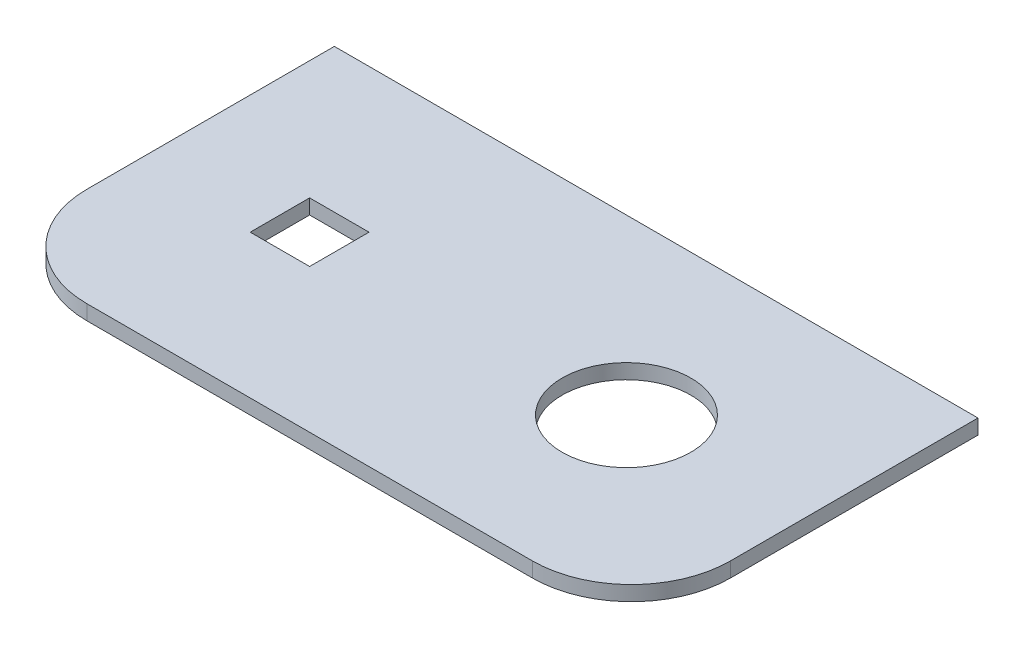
ISO-10303-21;
HEADER;
FILE_DESCRIPTION(('STEP AP214'),'2;1');
FILE_NAME('part.step','',(''),(''),'','','');
FILE_SCHEMA(('AUTOMOTIVE_DESIGN { 1 0 10303 214 1 1 1 1 }'));
ENDSEC;
DATA;
#1=APPLICATION_CONTEXT('core data for automotive mechanical design processes');
#2=APPLICATION_PROTOCOL_DEFINITION('international standard','automotive_design',2000,#1);
#3=PRODUCT_CONTEXT('',#1,'mechanical');
#4=PRODUCT('Part','Part','',(#3));
#5=PRODUCT_RELATED_PRODUCT_CATEGORY('part','',(#4));
#6=PRODUCT_DEFINITION_FORMATION('','',#4);
#7=PRODUCT_DEFINITION_CONTEXT('part definition',#1,'design');
#8=PRODUCT_DEFINITION('design','',#6,#7);
#9=PRODUCT_DEFINITION_SHAPE('','',#8);
#10=(LENGTH_UNIT() NAMED_UNIT(*) SI_UNIT(.MILLI.,.METRE.));
#11=(NAMED_UNIT(*) PLANE_ANGLE_UNIT() SI_UNIT($,.RADIAN.));
#12=(NAMED_UNIT(*) SI_UNIT($,.STERADIAN.) SOLID_ANGLE_UNIT());
#13=UNCERTAINTY_MEASURE_WITH_UNIT(LENGTH_MEASURE(1.E-05),#10,'distance_accuracy_value','');
#14=(GEOMETRIC_REPRESENTATION_CONTEXT(3) GLOBAL_UNCERTAINTY_ASSIGNED_CONTEXT((#13)) GLOBAL_UNIT_ASSIGNED_CONTEXT((#10,
#11,#12)) REPRESENTATION_CONTEXT('',''));
#15=CARTESIAN_POINT('',(0.,0.,0.));
#16=DIRECTION('',(0.,0.,1.));
#17=DIRECTION('',(1.,0.,0.));
#18=AXIS2_PLACEMENT_3D('',#15,#16,#17);
#19=CARTESIAN_POINT('',(20.,3.,-20.));
#20=DIRECTION('',(0.,-1.,0.));
#21=DIRECTION('',(0.,0.,-1.));
#22=AXIS2_PLACEMENT_3D('',#19,#20,#21);
#23=PLANE('',#22);
#24=DIRECTION('',(0.,0.,-1.));
#25=VECTOR('',#24,1.);
#26=CARTESIAN_POINT('',(130.,3.,-20.0000000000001));
#27=LINE('',#26,#25);
#28=CARTESIAN_POINT('',(130.,3.,-20.0000000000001));
#29=VERTEX_POINT('',#28);
#30=CARTESIAN_POINT('',(130.,3.,-70.));
#31=VERTEX_POINT('',#30);
#32=EDGE_CURVE('E174',#29,#31,#27,.T.);
#33=ORIENTED_EDGE('',*,*,#32,.T.);
#34=DIRECTION('',(-1.,0.,0.));
#35=VECTOR('',#34,1.);
#36=CARTESIAN_POINT('',(0.,3.,-70.));
#37=LINE('',#36,#35);
#38=CARTESIAN_POINT('',(0.,3.,-70.));
#39=VERTEX_POINT('',#38);
#40=EDGE_CURVE('E178',#31,#39,#37,.T.);
#41=ORIENTED_EDGE('',*,*,#40,.T.);
#42=DIRECTION('',(0.,0.,1.));
#43=VECTOR('',#42,1.);
#44=CARTESIAN_POINT('',(0.,3.,-20.0000000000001));
#45=LINE('',#44,#43);
#46=CARTESIAN_POINT('',(0.,3.,-20.0000000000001));
#47=VERTEX_POINT('',#46);
#48=EDGE_CURVE('E182',#39,#47,#45,.T.);
#49=ORIENTED_EDGE('',*,*,#48,.T.);
#50=CARTESIAN_POINT('',(20.,3.,-20.));
#51=DIRECTION('',(0.,1.,0.));
#52=DIRECTION('',(0.,0.,-1.));
#53=AXIS2_PLACEMENT_3D('',#50,#51,#52);
#54=CIRCLE('',#53,20.);
#55=CARTESIAN_POINT('',(20.0000000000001,3.,0.));
#56=VERTEX_POINT('',#55);
#57=EDGE_CURVE('E185',#47,#56,#54,.T.);
#58=ORIENTED_EDGE('',*,*,#57,.T.);
#59=DIRECTION('',(1.,0.,0.));
#60=VECTOR('',#59,1.);
#61=CARTESIAN_POINT('',(20.0000000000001,3.,0.));
#62=LINE('',#61,#60);
#63=CARTESIAN_POINT('',(110.,3.,0.));
#64=VERTEX_POINT('',#63);
#65=EDGE_CURVE('E188',#56,#64,#62,.T.);
#66=ORIENTED_EDGE('',*,*,#65,.T.);
#67=CARTESIAN_POINT('',(110.,3.,-20.));
#68=DIRECTION('',(0.,1.,0.));
#69=DIRECTION('',(0.,0.,1.));
#70=AXIS2_PLACEMENT_3D('',#67,#68,#69);
#71=CIRCLE('',#70,20.);
#72=EDGE_CURVE('E191',#64,#29,#71,.T.);
#73=ORIENTED_EDGE('',*,*,#72,.T.);
#74=EDGE_LOOP('',(#33,#41,#49,#58,#66,#73));
#75=FACE_BOUND('',#74,.T.);
#76=DIRECTION('',(0.,0.,-1.));
#77=VECTOR('',#76,1.);
#78=CARTESIAN_POINT('',(36.,3.,-41.));
#79=LINE('',#78,#77);
#80=CARTESIAN_POINT('',(36.,3.,-29.));
#81=VERTEX_POINT('',#80);
#82=CARTESIAN_POINT('',(36.,3.,-41.));
#83=VERTEX_POINT('',#82);
#84=EDGE_CURVE('E123',#81,#83,#79,.T.);
#85=ORIENTED_EDGE('',*,*,#84,.F.);
#86=DIRECTION('',(1.,0.,0.));
#87=VECTOR('',#86,1.);
#88=CARTESIAN_POINT('',(24.,3.,-29.));
#89=LINE('',#88,#87);
#90=CARTESIAN_POINT('',(24.,3.,-29.));
#91=VERTEX_POINT('',#90);
#92=EDGE_CURVE('E150',#91,#81,#89,.T.);
#93=ORIENTED_EDGE('',*,*,#92,.F.);
#94=DIRECTION('',(0.,0.,1.));
#95=VECTOR('',#94,1.);
#96=CARTESIAN_POINT('',(24.,3.,-41.));
#97=LINE('',#96,#95);
#98=CARTESIAN_POINT('',(24.,3.,-41.));
#99=VERTEX_POINT('',#98);
#100=EDGE_CURVE('E146',#99,#91,#97,.T.);
#101=ORIENTED_EDGE('',*,*,#100,.F.);
#102=DIRECTION('',(-1.,0.,0.));
#103=VECTOR('',#102,1.);
#104=CARTESIAN_POINT('',(24.,3.,-41.));
#105=LINE('',#104,#103);
#106=EDGE_CURVE('E132',#83,#99,#105,.T.);
#107=ORIENTED_EDGE('',*,*,#106,.F.);
#108=EDGE_LOOP('',(#85,#93,#101,#107));
#109=FACE_BOUND('',#108,.T.);
#110=CARTESIAN_POINT('',(94.,3.,-35.));
#111=DIRECTION('',(0.,1.,0.));
#112=DIRECTION('',(0.,0.,1.));
#113=AXIS2_PLACEMENT_3D('',#110,#111,#112);
#114=CIRCLE('',#113,13.);
#115=CARTESIAN_POINT('',(94.,3.,-22.));
#116=VERTEX_POINT('',#115);
#117=EDGE_CURVE('E158',#116,#116,#114,.T.);
#118=ORIENTED_EDGE('',*,*,#117,.F.);
#119=EDGE_LOOP('',(#118));
#120=FACE_BOUND('',#119,.T.);
#121=ADVANCED_FACE('F45',(#75,#109,#120),#23,.F.);
#122=CARTESIAN_POINT('',(20.,0.,-20.));
#123=DIRECTION('',(0.,-1.,0.));
#124=DIRECTION('',(0.,0.,-1.));
#125=AXIS2_PLACEMENT_3D('',#122,#123,#124);
#126=PLANE('',#125);
#127=DIRECTION('',(1.,0.,0.));
#128=VECTOR('',#127,1.);
#129=CARTESIAN_POINT('',(24.,0.,-29.));
#130=LINE('',#129,#128);
#131=CARTESIAN_POINT('',(24.,0.,-29.));
#132=VERTEX_POINT('',#131);
#133=CARTESIAN_POINT('',(36.,0.,-29.));
#134=VERTEX_POINT('',#133);
#135=EDGE_CURVE('E133',#132,#134,#130,.T.);
#136=ORIENTED_EDGE('',*,*,#135,.T.);
#137=DIRECTION('',(0.,0.,-1.));
#138=VECTOR('',#137,1.);
#139=CARTESIAN_POINT('',(36.,0.,-41.));
#140=LINE('',#139,#138);
#141=CARTESIAN_POINT('',(36.,0.,-41.));
#142=VERTEX_POINT('',#141);
#143=EDGE_CURVE('E69',#134,#142,#140,.T.);
#144=ORIENTED_EDGE('',*,*,#143,.T.);
#145=DIRECTION('',(-1.,0.,0.));
#146=VECTOR('',#145,1.);
#147=CARTESIAN_POINT('',(24.,0.,-41.));
#148=LINE('',#147,#146);
#149=CARTESIAN_POINT('',(24.,0.,-41.));
#150=VERTEX_POINT('',#149);
#151=EDGE_CURVE('E139',#142,#150,#148,.T.);
#152=ORIENTED_EDGE('',*,*,#151,.T.);
#153=DIRECTION('',(0.,0.,1.));
#154=VECTOR('',#153,1.);
#155=CARTESIAN_POINT('',(24.,0.,-41.));
#156=LINE('',#155,#154);
#157=EDGE_CURVE('E161',#150,#132,#156,.T.);
#158=ORIENTED_EDGE('',*,*,#157,.T.);
#159=EDGE_LOOP('',(#136,#144,#152,#158));
#160=FACE_BOUND('',#159,.T.);
#161=DIRECTION('',(0.,0.,-1.));
#162=VECTOR('',#161,1.);
#163=CARTESIAN_POINT('',(130.,0.,-20.0000000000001));
#164=LINE('',#163,#162);
#165=CARTESIAN_POINT('',(130.,0.,-20.0000000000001));
#166=VERTEX_POINT('',#165);
#167=CARTESIAN_POINT('',(130.,0.,-70.));
#168=VERTEX_POINT('',#167);
#169=EDGE_CURVE('E141',#166,#168,#164,.T.);
#170=ORIENTED_EDGE('',*,*,#169,.F.);
#171=CARTESIAN_POINT('',(110.,0.,-20.));
#172=DIRECTION('',(0.,1.,0.));
#173=DIRECTION('',(0.,0.,1.));
#174=AXIS2_PLACEMENT_3D('',#171,#172,#173);
#175=CIRCLE('',#174,20.);
#176=CARTESIAN_POINT('',(110.,0.,0.));
#177=VERTEX_POINT('',#176);
#178=EDGE_CURVE('E179',#177,#166,#175,.T.);
#179=ORIENTED_EDGE('',*,*,#178,.F.);
#180=DIRECTION('',(1.,0.,0.));
#181=VECTOR('',#180,1.);
#182=CARTESIAN_POINT('',(20.0000000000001,0.,0.));
#183=LINE('',#182,#181);
#184=CARTESIAN_POINT('',(20.0000000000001,0.,0.));
#185=VERTEX_POINT('',#184);
#186=EDGE_CURVE('E207',#185,#177,#183,.T.);
#187=ORIENTED_EDGE('',*,*,#186,.F.);
#188=CARTESIAN_POINT('',(20.,0.,-20.));
#189=DIRECTION('',(0.,1.,0.));
#190=DIRECTION('',(0.,0.,-1.));
#191=AXIS2_PLACEMENT_3D('',#188,#189,#190);
#192=CIRCLE('',#191,20.);
#193=CARTESIAN_POINT('',(0.,0.,-20.0000000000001));
#194=VERTEX_POINT('',#193);
#195=EDGE_CURVE('E204',#194,#185,#192,.T.);
#196=ORIENTED_EDGE('',*,*,#195,.F.);
#197=DIRECTION('',(0.,0.,1.));
#198=VECTOR('',#197,1.);
#199=CARTESIAN_POINT('',(0.,0.,-20.0000000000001));
#200=LINE('',#199,#198);
#201=CARTESIAN_POINT('',(0.,0.,-70.));
#202=VERTEX_POINT('',#201);
#203=EDGE_CURVE('E201',#202,#194,#200,.T.);
#204=ORIENTED_EDGE('',*,*,#203,.F.);
#205=DIRECTION('',(-1.,0.,0.));
#206=VECTOR('',#205,1.);
#207=CARTESIAN_POINT('',(0.,0.,-70.));
#208=LINE('',#207,#206);
#209=EDGE_CURVE('E198',#168,#202,#208,.T.);
#210=ORIENTED_EDGE('',*,*,#209,.F.);
#211=EDGE_LOOP('',(#170,#179,#187,#196,#204,#210));
#212=FACE_BOUND('',#211,.T.);
#213=CARTESIAN_POINT('',(94.,0.,-35.));
#214=DIRECTION('',(0.,1.,0.));
#215=DIRECTION('',(0.,0.,1.));
#216=AXIS2_PLACEMENT_3D('',#213,#214,#215);
#217=CIRCLE('',#216,13.);
#218=CARTESIAN_POINT('',(94.,0.,-22.));
#219=VERTEX_POINT('',#218);
#220=EDGE_CURVE('E294',#219,#219,#217,.T.);
#221=ORIENTED_EDGE('',*,*,#220,.T.);
#222=EDGE_LOOP('',(#221));
#223=FACE_BOUND('',#222,.T.);
#224=ADVANCED_FACE('F238',(#160,#212,#223),#126,.T.);
#225=CARTESIAN_POINT('',(130.,3.,-20.0000000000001));
#226=DIRECTION('',(-1.,0.,0.));
#227=DIRECTION('',(0.,0.,1.));
#228=AXIS2_PLACEMENT_3D('',#225,#226,#227);
#229=PLANE('',#228);
#230=ORIENTED_EDGE('',*,*,#169,.T.);
#231=DIRECTION('',(0.,-1.,0.));
#232=VECTOR('',#231,1.);
#233=CARTESIAN_POINT('',(130.,3.,-70.));
#234=LINE('',#233,#232);
#235=EDGE_CURVE('E11',#31,#168,#234,.T.);
#236=ORIENTED_EDGE('',*,*,#235,.F.);
#237=ORIENTED_EDGE('',*,*,#32,.F.);
#238=DIRECTION('',(0.,-1.,0.));
#239=VECTOR('',#238,1.);
#240=CARTESIAN_POINT('',(130.,3.,-20.0000000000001));
#241=LINE('',#240,#239);
#242=EDGE_CURVE('E194',#29,#166,#241,.T.);
#243=ORIENTED_EDGE('',*,*,#242,.T.);
#244=EDGE_LOOP('',(#230,#236,#237,#243));
#245=FACE_BOUND('',#244,.T.);
#246=ADVANCED_FACE('F47',(#245),#229,.F.);
#247=CARTESIAN_POINT('',(0.,3.,-70.));
#248=DIRECTION('',(0.,0.,1.));
#249=DIRECTION('',(1.,0.,0.));
#250=AXIS2_PLACEMENT_3D('',#247,#248,#249);
#251=PLANE('',#250);
#252=ORIENTED_EDGE('',*,*,#209,.T.);
#253=DIRECTION('',(0.,-1.,0.));
#254=VECTOR('',#253,1.);
#255=CARTESIAN_POINT('',(0.,3.,-70.));
#256=LINE('',#255,#254);
#257=EDGE_CURVE('E54',#39,#202,#256,.T.);
#258=ORIENTED_EDGE('',*,*,#257,.F.);
#259=ORIENTED_EDGE('',*,*,#40,.F.);
#260=ORIENTED_EDGE('',*,*,#235,.T.);
#261=EDGE_LOOP('',(#252,#258,#259,#260));
#262=FACE_BOUND('',#261,.T.);
#263=ADVANCED_FACE('F255',(#262),#251,.F.);
#264=CARTESIAN_POINT('',(0.,3.,-20.0000000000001));
#265=DIRECTION('',(1.,0.,0.));
#266=DIRECTION('',(0.,0.,-1.));
#267=AXIS2_PLACEMENT_3D('',#264,#265,#266);
#268=PLANE('',#267);
#269=ORIENTED_EDGE('',*,*,#203,.T.);
#270=DIRECTION('',(0.,-1.,0.));
#271=VECTOR('',#270,1.);
#272=CARTESIAN_POINT('',(0.,3.,-20.0000000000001));
#273=LINE('',#272,#271);
#274=EDGE_CURVE('E223',#47,#194,#273,.T.);
#275=ORIENTED_EDGE('',*,*,#274,.F.);
#276=ORIENTED_EDGE('',*,*,#48,.F.);
#277=ORIENTED_EDGE('',*,*,#257,.T.);
#278=EDGE_LOOP('',(#269,#275,#276,#277));
#279=FACE_BOUND('',#278,.T.);
#280=ADVANCED_FACE('F232',(#279),#268,.F.);
#281=CARTESIAN_POINT('',(20.,3.,-20.));
#282=DIRECTION('',(0.,-1.,0.));
#283=DIRECTION('',(0.,0.,-1.));
#284=AXIS2_PLACEMENT_3D('',#281,#282,#283);
#285=CYLINDRICAL_SURFACE('',#284,20.);
#286=ORIENTED_EDGE('',*,*,#195,.T.);
#287=DIRECTION('',(0.,-1.,0.));
#288=VECTOR('',#287,1.);
#289=CARTESIAN_POINT('',(20.0000000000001,3.,0.));
#290=LINE('',#289,#288);
#291=EDGE_CURVE('E219',#56,#185,#290,.T.);
#292=ORIENTED_EDGE('',*,*,#291,.F.);
#293=ORIENTED_EDGE('',*,*,#57,.F.);
#294=ORIENTED_EDGE('',*,*,#274,.T.);
#295=EDGE_LOOP('',(#286,#292,#293,#294));
#296=FACE_BOUND('',#295,.T.);
#297=ADVANCED_FACE('F244',(#296),#285,.T.);
#298=CARTESIAN_POINT('',(20.0000000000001,3.,0.));
#299=DIRECTION('',(0.,0.,-1.));
#300=DIRECTION('',(-1.,0.,0.));
#301=AXIS2_PLACEMENT_3D('',#298,#299,#300);
#302=PLANE('',#301);
#303=ORIENTED_EDGE('',*,*,#186,.T.);
#304=DIRECTION('',(0.,-1.,0.));
#305=VECTOR('',#304,1.);
#306=CARTESIAN_POINT('',(110.,3.,0.));
#307=LINE('',#306,#305);
#308=EDGE_CURVE('E215',#64,#177,#307,.T.);
#309=ORIENTED_EDGE('',*,*,#308,.F.);
#310=ORIENTED_EDGE('',*,*,#65,.F.);
#311=ORIENTED_EDGE('',*,*,#291,.T.);
#312=EDGE_LOOP('',(#303,#309,#310,#311));
#313=FACE_BOUND('',#312,.T.);
#314=ADVANCED_FACE('F248',(#313),#302,.F.);
#315=CARTESIAN_POINT('',(110.,3.,-20.));
#316=DIRECTION('',(0.,-1.,0.));
#317=DIRECTION('',(0.,0.,-1.));
#318=AXIS2_PLACEMENT_3D('',#315,#316,#317);
#319=CYLINDRICAL_SURFACE('',#318,20.);
#320=ORIENTED_EDGE('',*,*,#178,.T.);
#321=ORIENTED_EDGE('',*,*,#242,.F.);
#322=ORIENTED_EDGE('',*,*,#72,.F.);
#323=ORIENTED_EDGE('',*,*,#308,.T.);
#324=EDGE_LOOP('',(#320,#321,#322,#323));
#325=FACE_BOUND('',#324,.T.);
#326=ADVANCED_FACE('F258',(#325),#319,.T.);
#327=CARTESIAN_POINT('',(36.,3.,-41.));
#328=DIRECTION('',(-1.,0.,0.));
#329=DIRECTION('',(0.,0.,1.));
#330=AXIS2_PLACEMENT_3D('',#327,#328,#329);
#331=PLANE('',#330);
#332=ORIENTED_EDGE('',*,*,#143,.F.);
#333=DIRECTION('',(0.,-1.,0.));
#334=VECTOR('',#333,1.);
#335=CARTESIAN_POINT('',(36.,3.,-29.));
#336=LINE('',#335,#334);
#337=EDGE_CURVE('E127',#81,#134,#336,.T.);
#338=ORIENTED_EDGE('',*,*,#337,.F.);
#339=ORIENTED_EDGE('',*,*,#84,.T.);
#340=DIRECTION('',(0.,-1.,0.));
#341=VECTOR('',#340,1.);
#342=CARTESIAN_POINT('',(36.,3.,-41.));
#343=LINE('',#342,#341);
#344=EDGE_CURVE('E126',#83,#142,#343,.T.);
#345=ORIENTED_EDGE('',*,*,#344,.T.);
#346=EDGE_LOOP('',(#332,#338,#339,#345));
#347=FACE_BOUND('',#346,.T.);
#348=ADVANCED_FACE('F125',(#347),#331,.T.);
#349=CARTESIAN_POINT('',(24.,3.,-41.));
#350=DIRECTION('',(0.,0.,1.));
#351=DIRECTION('',(1.,0.,0.));
#352=AXIS2_PLACEMENT_3D('',#349,#350,#351);
#353=PLANE('',#352);
#354=ORIENTED_EDGE('',*,*,#151,.F.);
#355=ORIENTED_EDGE('',*,*,#344,.F.);
#356=ORIENTED_EDGE('',*,*,#106,.T.);
#357=DIRECTION('',(0.,-1.,0.));
#358=VECTOR('',#357,1.);
#359=CARTESIAN_POINT('',(24.,3.,-41.));
#360=LINE('',#359,#358);
#361=EDGE_CURVE('E142',#99,#150,#360,.T.);
#362=ORIENTED_EDGE('',*,*,#361,.T.);
#363=EDGE_LOOP('',(#354,#355,#356,#362));
#364=FACE_BOUND('',#363,.T.);
#365=ADVANCED_FACE('F136',(#364),#353,.T.);
#366=CARTESIAN_POINT('',(24.,3.,-41.));
#367=DIRECTION('',(1.,0.,0.));
#368=DIRECTION('',(0.,0.,-1.));
#369=AXIS2_PLACEMENT_3D('',#366,#367,#368);
#370=PLANE('',#369);
#371=ORIENTED_EDGE('',*,*,#157,.F.);
#372=ORIENTED_EDGE('',*,*,#361,.F.);
#373=ORIENTED_EDGE('',*,*,#100,.T.);
#374=DIRECTION('',(0.,-1.,0.));
#375=VECTOR('',#374,1.);
#376=CARTESIAN_POINT('',(24.,3.,-29.));
#377=LINE('',#376,#375);
#378=EDGE_CURVE('E61',#91,#132,#377,.T.);
#379=ORIENTED_EDGE('',*,*,#378,.T.);
#380=EDGE_LOOP('',(#371,#372,#373,#379));
#381=FACE_BOUND('',#380,.T.);
#382=ADVANCED_FACE('F277',(#381),#370,.T.);
#383=CARTESIAN_POINT('',(24.,3.,-29.));
#384=DIRECTION('',(0.,0.,-1.));
#385=DIRECTION('',(-1.,0.,0.));
#386=AXIS2_PLACEMENT_3D('',#383,#384,#385);
#387=PLANE('',#386);
#388=ORIENTED_EDGE('',*,*,#135,.F.);
#389=ORIENTED_EDGE('',*,*,#378,.F.);
#390=ORIENTED_EDGE('',*,*,#92,.T.);
#391=ORIENTED_EDGE('',*,*,#337,.T.);
#392=EDGE_LOOP('',(#388,#389,#390,#391));
#393=FACE_BOUND('',#392,.T.);
#394=ADVANCED_FACE('F280',(#393),#387,.T.);
#395=CARTESIAN_POINT('',(94.,3.,-35.));
#396=DIRECTION('',(0.,-1.,0.));
#397=DIRECTION('',(0.,0.,-1.));
#398=AXIS2_PLACEMENT_3D('',#395,#396,#397);
#399=CYLINDRICAL_SURFACE('',#398,13.);
#400=ORIENTED_EDGE('',*,*,#117,.T.);
#401=EDGE_LOOP('',(#400));
#402=FACE_BOUND('',#401,.T.);
#403=ORIENTED_EDGE('',*,*,#220,.F.);
#404=EDGE_LOOP('',(#403));
#405=FACE_BOUND('',#404,.T.);
#406=ADVANCED_FACE('F284',(#402,#405),#399,.F.);
#407=CLOSED_SHELL('',(#121,#224,#246,#263,#280,#297,#314,#326,#348,#365,#382,#394,#406));
#408=MANIFOLD_SOLID_BREP('B2',#407);
#409=ADVANCED_BREP_SHAPE_REPRESENTATION('',(#18,#408),#14);
#410=SHAPE_DEFINITION_REPRESENTATION(#9,#409);
ENDSEC;
END-ISO-10303-21;
